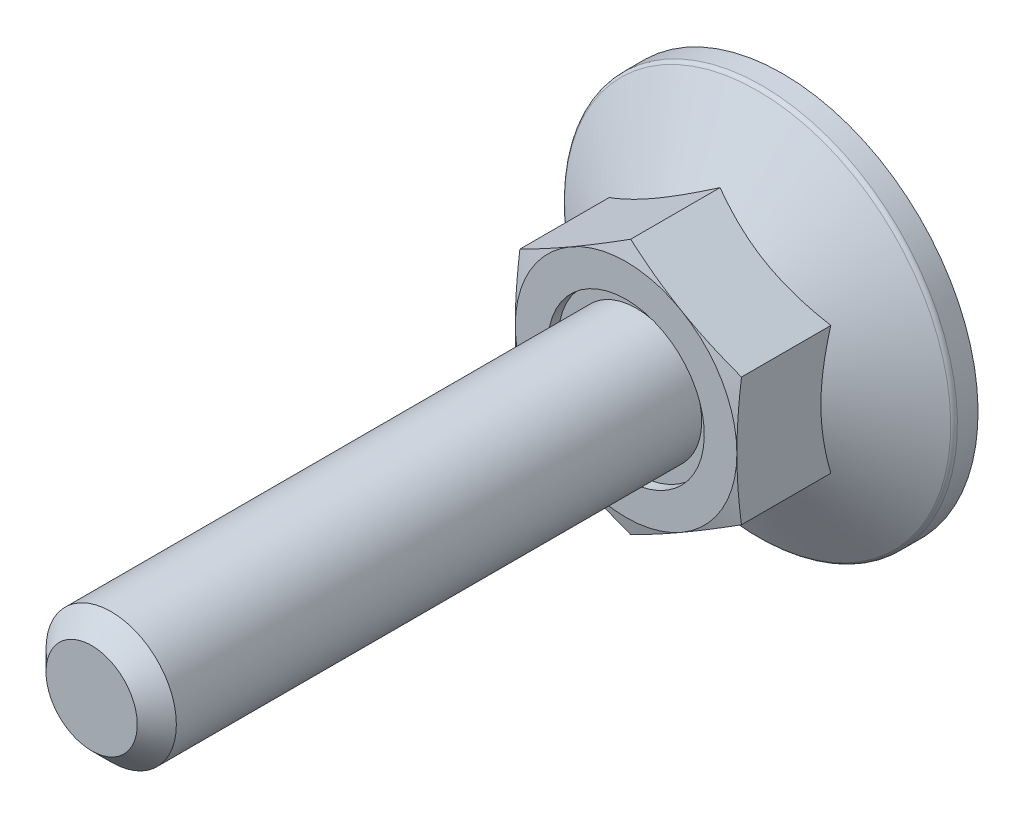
ISO-10303-21;
HEADER;
FILE_DESCRIPTION(('STEP AP214'),'2;1');
FILE_NAME('part.step','',(''),(''),'','','');
FILE_SCHEMA(('AUTOMOTIVE_DESIGN { 1 0 10303 214 1 1 1 1 }'));
ENDSEC;
DATA;
#1=APPLICATION_CONTEXT('core data for automotive mechanical design processes');
#2=APPLICATION_PROTOCOL_DEFINITION('international standard','automotive_design',2000,#1);
#3=PRODUCT_CONTEXT('',#1,'mechanical');
#4=PRODUCT('Part','Part','',(#3));
#5=PRODUCT_RELATED_PRODUCT_CATEGORY('part','',(#4));
#6=PRODUCT_DEFINITION_FORMATION('','',#4);
#7=PRODUCT_DEFINITION_CONTEXT('part definition',#1,'design');
#8=PRODUCT_DEFINITION('design','',#6,#7);
#9=PRODUCT_DEFINITION_SHAPE('','',#8);
#10=(LENGTH_UNIT() NAMED_UNIT(*) SI_UNIT(.MILLI.,.METRE.));
#11=(NAMED_UNIT(*) PLANE_ANGLE_UNIT() SI_UNIT($,.RADIAN.));
#12=(NAMED_UNIT(*) SI_UNIT($,.STERADIAN.) SOLID_ANGLE_UNIT());
#13=UNCERTAINTY_MEASURE_WITH_UNIT(LENGTH_MEASURE(1.E-05),#10,'distance_accuracy_value','');
#14=(GEOMETRIC_REPRESENTATION_CONTEXT(3) GLOBAL_UNCERTAINTY_ASSIGNED_CONTEXT((#13)) GLOBAL_UNIT_ASSIGNED_CONTEXT((#10,
#11,#12)) REPRESENTATION_CONTEXT('',''));
#15=CARTESIAN_POINT('',(0.,0.,0.));
#16=DIRECTION('',(0.,0.,1.));
#17=DIRECTION('',(1.,0.,0.));
#18=AXIS2_PLACEMENT_3D('',#15,#16,#17);
#19=CARTESIAN_POINT('',(0.,0.,11.2));
#20=DIRECTION('',(0.,0.,-1.));
#21=DIRECTION('',(0.,1.,0.));
#22=AXIS2_PLACEMENT_3D('',#19,#20,#21);
#23=PLANE('',#22);
#24=CARTESIAN_POINT('',(0.,0.,11.2));
#25=DIRECTION('',(0.,0.,-1.));
#26=DIRECTION('',(0.,1.,0.));
#27=AXIS2_PLACEMENT_3D('',#24,#25,#26);
#28=CIRCLE('',#27,6.);
#29=CARTESIAN_POINT('',(0.,6.,11.2));
#30=VERTEX_POINT('',#29);
#31=EDGE_CURVE('E108',#30,#30,#28,.T.);
#32=ORIENTED_EDGE('',*,*,#31,.F.);
#33=EDGE_LOOP('',(#32));
#34=FACE_BOUND('',#33,.T.);
#35=CARTESIAN_POINT('',(0.,0.,11.2));
#36=DIRECTION('',(0.,0.,-1.));
#37=DIRECTION('',(0.,1.,0.));
#38=AXIS2_PLACEMENT_3D('',#35,#36,#37);
#39=CIRCLE('',#38,5.);
#40=CARTESIAN_POINT('',(0.,5.,11.2));
#41=VERTEX_POINT('',#40);
#42=EDGE_CURVE('E259',#41,#41,#39,.F.);
#43=ORIENTED_EDGE('',*,*,#42,.F.);
#44=EDGE_LOOP('',(#43));
#45=FACE_BOUND('',#44,.T.);
#46=ADVANCED_FACE('F14',(#34,#45),#23,.F.);
#47=CARTESIAN_POINT('',(0.,9.81495457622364,32.));
#48=DIRECTION('',(0.5,-0.866025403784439,0.));
#49=DIRECTION('',(0.866025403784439,0.5,0.));
#50=AXIS2_PLACEMENT_3D('',#47,#48,#49);
#51=PLANE('',#50);
#52=CARTESIAN_POINT('',(-8.5002,4.90736181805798,4.7935207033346));
#53=CARTESIAN_POINT('',(-8.31336077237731,5.01523349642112,4.85579061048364));
#54=CARTESIAN_POINT('',(-8.1258249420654,5.1235073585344,4.91523445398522));
#55=CARTESIAN_POINT('',(-7.74923024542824,5.34093440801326,5.02769163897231));
#56=CARTESIAN_POINT('',(-7.56017075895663,5.45008795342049,5.08070220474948));
#57=CARTESIAN_POINT('',(-6.9899652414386,5.77929626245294,5.22904336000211));
#58=CARTESIAN_POINT('',(-6.60656835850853,6.00065055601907,5.31341782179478));
#59=CARTESIAN_POINT('',(-6.03282233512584,6.33190297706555,5.41235673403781));
#60=CARTESIAN_POINT('',(-5.84418723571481,6.44081150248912,5.44054155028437));
#61=CARTESIAN_POINT('',(-5.46606397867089,6.65912106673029,5.48780266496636));
#62=CARTESIAN_POINT('',(-5.27657589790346,6.76852206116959,5.5068797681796));
#63=CARTESIAN_POINT('',(-4.8972734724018,6.98751241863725,5.53544197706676));
#64=CARTESIAN_POINT('',(-4.70745974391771,7.09710142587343,5.54493796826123));
#65=CARTESIAN_POINT('',(-4.32765694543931,7.3163806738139,5.55413437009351));
#66=CARTESIAN_POINT('',(-4.13766788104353,7.42607091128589,5.55383508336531));
#67=CARTESIAN_POINT('',(-3.78247698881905,7.63114046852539,5.54412227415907));
#68=CARTESIAN_POINT('',(-3.6172500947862,7.72653426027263,5.53589358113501));
#69=CARTESIAN_POINT('',(-3.28718328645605,7.9170984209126,5.51218750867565));
#70=CARTESIAN_POINT('',(-3.12234339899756,8.01226877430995,5.49670964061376));
#71=CARTESIAN_POINT('',(-2.62846189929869,8.29741139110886,5.43976812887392));
#72=CARTESIAN_POINT('',(-2.30029449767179,8.48687892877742,5.38780368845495));
#73=CARTESIAN_POINT('',(-1.64047857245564,8.86782383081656,5.25789180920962));
#74=CARTESIAN_POINT('',(-1.30891425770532,9.05925257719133,5.17939367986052));
#75=CARTESIAN_POINT('',(-0.650730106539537,9.43925537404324,5.00123540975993));
#76=CARTESIAN_POINT('',(-0.32410184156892,9.62783429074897,4.90161711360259));
#77=CARTESIAN_POINT('',(0.000200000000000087,9.81507004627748,4.7935207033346));
#78=B_SPLINE_CURVE_WITH_KNOTS('',3,(#52,#53,#54,#55,#56,#57,#58,#59,#60,#61,#62,#63,#64,#65,#66,
#67,#68,#69,#70,#71,#72,#73,#74,#75,#76,#77),.UNSPECIFIED.,.F.,.F.,(4,2,2,2,2,2,2,2,2,2,2,2,4),
(0.,0.673596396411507,1.34748239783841,2.69805431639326,3.356799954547,4.01548737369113,
4.67342558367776,5.33134346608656,5.90409556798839,6.47688628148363,7.62328361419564,
8.79510569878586,9.9646274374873),.UNSPECIFIED.);
#79=CARTESIAN_POINT('',(-8.5,4.90747728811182,4.79358737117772));
#80=VERTEX_POINT('',#79);
#81=CARTESIAN_POINT('',(0.,9.81495457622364,4.79358737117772));
#82=VERTEX_POINT('',#81);
#83=EDGE_CURVE('E97',#80,#82,#78,.T.);
#84=ORIENTED_EDGE('',*,*,#83,.F.);
#85=DIRECTION('',(0.,0.,-1.));
#86=VECTOR('',#85,1.);
#87=CARTESIAN_POINT('',(-8.5,4.90747728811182,32.));
#88=LINE('',#87,#86);
#89=CARTESIAN_POINT('',(-8.5,4.90747728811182,11.6476589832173));
#90=VERTEX_POINT('',#89);
#91=EDGE_CURVE('E86',#90,#80,#88,.T.);
#92=ORIENTED_EDGE('',*,*,#91,.F.);
#93=CARTESIAN_POINT('',(0.000200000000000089,9.81507004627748,11.6476280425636));
#94=CARTESIAN_POINT('',(-0.352800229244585,9.61126526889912,11.7022599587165));
#95=CARTESIAN_POINT('',(-0.706440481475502,9.40709097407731,11.7518566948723));
#96=CARTESIAN_POINT('',(-1.41496987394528,8.99802133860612,11.8389934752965));
#97=CARTESIAN_POINT('',(-1.76985946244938,8.79312573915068,11.8765286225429));
#98=CARTESIAN_POINT('',(-2.47873586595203,8.38385575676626,11.9373509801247));
#99=CARTESIAN_POINT('',(-2.83271788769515,8.17948414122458,11.9607107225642));
#100=CARTESIAN_POINT('',(-3.5411333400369,7.77048028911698,11.9920337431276));
#101=CARTESIAN_POINT('',(-3.89556667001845,7.56584811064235,12.));
#102=CARTESIAN_POINT('',(-4.60443332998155,7.15658375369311,12.));
#103=CARTESIAN_POINT('',(-4.9588666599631,6.95195157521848,11.9920337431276));
#104=CARTESIAN_POINT('',(-5.66728211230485,6.54294772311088,11.9607107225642));
#105=CARTESIAN_POINT('',(-6.02126413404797,6.33857610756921,11.9373509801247));
#106=CARTESIAN_POINT('',(-6.73014053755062,5.92930612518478,11.8765286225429));
#107=CARTESIAN_POINT('',(-7.08503012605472,5.72441052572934,11.8389934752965));
#108=CARTESIAN_POINT('',(-7.7935595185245,5.31534089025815,11.7518566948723));
#109=CARTESIAN_POINT('',(-8.14719977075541,5.11116659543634,11.7022599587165));
#110=CARTESIAN_POINT('',(-8.5002,4.90736181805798,11.6476280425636));
#111=B_SPLINE_CURVE_WITH_KNOTS('',3,(#93,#94,#95,#96,#97,#98,#99,#100,#101,#102,#103,#104,#105,
#106,#107,#108,#109,#110),.UNSPECIFIED.,.F.,.F.,(4,2,2,2,2,2,2,2,4),(0.,1.23382789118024,
2.46815608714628,3.69611406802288,4.92383440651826,6.15155474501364,7.37951272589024,
8.61384092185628,9.84766881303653),.UNSPECIFIED.);
#112=CARTESIAN_POINT('',(-4.25,7.36121593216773,12.));
#113=VERTEX_POINT('',#112);
#114=EDGE_CURVE('E186',#113,#90,#111,.T.);
#115=ORIENTED_EDGE('',*,*,#114,.F.);
#116=CARTESIAN_POINT('',(0.,9.81495457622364,11.6476589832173));
#117=VERTEX_POINT('',#116);
#118=EDGE_CURVE('E318',#117,#113,#111,.T.);
#119=ORIENTED_EDGE('',*,*,#118,.F.);
#120=DIRECTION('',(0.,0.,-1.));
#121=VECTOR('',#120,1.);
#122=CARTESIAN_POINT('',(0.,9.81495457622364,32.));
#123=LINE('',#122,#121);
#124=EDGE_CURVE('E101',#117,#82,#123,.T.);
#125=ORIENTED_EDGE('',*,*,#124,.T.);
#126=EDGE_LOOP('',(#84,#92,#115,#119,#125));
#127=FACE_BOUND('',#126,.T.);
#128=ADVANCED_FACE('F100',(#127),#51,.F.);
#129=CARTESIAN_POINT('',(8.5,4.90747728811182,32.));
#130=DIRECTION('',(-0.5,-0.866025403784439,0.));
#131=DIRECTION('',(0.866025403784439,-0.5,0.));
#132=AXIS2_PLACEMENT_3D('',#129,#130,#131);
#133=PLANE('',#132);
#134=CARTESIAN_POINT('',(-0.0002,9.81507004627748,4.7935207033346));
#135=CARTESIAN_POINT('',(0.186639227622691,9.70719836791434,4.85579061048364));
#136=CARTESIAN_POINT('',(0.374175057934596,9.59892450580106,4.91523445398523));
#137=CARTESIAN_POINT('',(0.750769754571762,9.3814974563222,5.02769163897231));
#138=CARTESIAN_POINT('',(0.939829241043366,9.27234391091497,5.08070220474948));
#139=CARTESIAN_POINT('',(1.5100347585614,8.94313560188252,5.22904336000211));
#140=CARTESIAN_POINT('',(1.89343164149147,8.72178130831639,5.31341782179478));
#141=CARTESIAN_POINT('',(2.46717766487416,8.39052888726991,5.41235673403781));
#142=CARTESIAN_POINT('',(2.65581276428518,8.28162036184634,5.44054155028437));
#143=CARTESIAN_POINT('',(3.03393602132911,8.06331079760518,5.48780266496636));
#144=CARTESIAN_POINT('',(3.22342410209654,7.95390980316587,5.5068797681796));
#145=CARTESIAN_POINT('',(3.6027265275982,7.73491944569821,5.53544197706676));
#146=CARTESIAN_POINT('',(3.79254025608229,7.62533043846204,5.54493796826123));
#147=CARTESIAN_POINT('',(4.17234305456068,7.40605119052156,5.55413437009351));
#148=CARTESIAN_POINT('',(4.36233211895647,7.29636095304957,5.55383508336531));
#149=CARTESIAN_POINT('',(4.71752301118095,7.09129139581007,5.54412227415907));
#150=CARTESIAN_POINT('',(4.8827499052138,6.99589760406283,5.53589358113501));
#151=CARTESIAN_POINT('',(5.21281671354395,6.80533344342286,5.51218750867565));
#152=CARTESIAN_POINT('',(5.37765660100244,6.71016309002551,5.49670964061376));
#153=CARTESIAN_POINT('',(5.87153810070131,6.42502047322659,5.43976812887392));
#154=CARTESIAN_POINT('',(6.19970550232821,6.23555293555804,5.38780368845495));
#155=CARTESIAN_POINT('',(6.85952142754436,5.8546080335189,5.25789180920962));
#156=CARTESIAN_POINT('',(7.19108574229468,5.66317928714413,5.17939367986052));
#157=CARTESIAN_POINT('',(7.84926989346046,5.28317649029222,5.00123540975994));
#158=CARTESIAN_POINT('',(8.17589815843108,5.09459757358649,4.90161711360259));
#159=CARTESIAN_POINT('',(8.5002,4.90736181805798,4.7935207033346));
#160=B_SPLINE_CURVE_WITH_KNOTS('',3,(#134,#135,#136,#137,#138,#139,#140,#141,#142,#143,#144,
#145,#146,#147,#148,#149,#150,#151,#152,#153,#154,#155,#156,#157,#158,#159),.UNSPECIFIED.,.F.,
.F.,(4,2,2,2,2,2,2,2,2,2,2,2,4),(0.,0.673596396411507,1.34748239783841,2.69805431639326,
3.356799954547,4.01548737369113,4.67342558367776,5.33134346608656,5.90409556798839,
6.47688628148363,7.62328361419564,8.79510569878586,9.9646274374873),.UNSPECIFIED.);
#161=CARTESIAN_POINT('',(8.5,4.90747728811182,4.79358737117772));
#162=VERTEX_POINT('',#161);
#163=EDGE_CURVE('E29',#82,#162,#160,.T.);
#164=ORIENTED_EDGE('',*,*,#163,.F.);
#165=ORIENTED_EDGE('',*,*,#124,.F.);
#166=CARTESIAN_POINT('',(8.5002,4.90736181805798,11.6476280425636));
#167=CARTESIAN_POINT('',(8.14719977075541,5.11116659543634,11.7022599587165));
#168=CARTESIAN_POINT('',(7.7935595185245,5.31534089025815,11.7518566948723));
#169=CARTESIAN_POINT('',(7.08503012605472,5.72441052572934,11.8389934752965));
#170=CARTESIAN_POINT('',(6.73014053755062,5.92930612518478,11.8765286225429));
#171=CARTESIAN_POINT('',(6.02126413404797,6.33857610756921,11.9373509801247));
#172=CARTESIAN_POINT('',(5.66728211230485,6.54294772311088,11.9607107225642));
#173=CARTESIAN_POINT('',(4.9588666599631,6.95195157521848,11.9920337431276));
#174=CARTESIAN_POINT('',(4.60443332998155,7.15658375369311,12.));
#175=CARTESIAN_POINT('',(3.89556667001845,7.56584811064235,12.));
#176=CARTESIAN_POINT('',(3.5411333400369,7.77048028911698,11.9920337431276));
#177=CARTESIAN_POINT('',(2.83271788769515,8.17948414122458,11.9607107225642));
#178=CARTESIAN_POINT('',(2.47873586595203,8.38385575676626,11.9373509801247));
#179=CARTESIAN_POINT('',(1.76985946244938,8.79312573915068,11.8765286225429));
#180=CARTESIAN_POINT('',(1.41496987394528,8.99802133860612,11.8389934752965));
#181=CARTESIAN_POINT('',(0.706440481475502,9.40709097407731,11.7518566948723));
#182=CARTESIAN_POINT('',(0.352800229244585,9.61126526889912,11.7022599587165));
#183=CARTESIAN_POINT('',(-0.000200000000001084,9.81507004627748,11.6476280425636));
#184=B_SPLINE_CURVE_WITH_KNOTS('',3,(#166,#167,#168,#169,#170,#171,#172,#173,#174,#175,#176,
#177,#178,#179,#180,#181,#182,#183),.UNSPECIFIED.,.F.,.F.,(4,2,2,2,2,2,2,2,4),(0.,
1.23382789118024,2.46815608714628,3.69611406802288,4.92383440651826,6.15155474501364,
7.37951272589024,8.61384092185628,9.84766881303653),.UNSPECIFIED.);
#185=CARTESIAN_POINT('',(4.25,7.36121593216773,12.));
#186=VERTEX_POINT('',#185);
#187=EDGE_CURVE('E177',#186,#117,#184,.T.);
#188=ORIENTED_EDGE('',*,*,#187,.F.);
#189=CARTESIAN_POINT('',(8.5,4.90747728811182,11.6476589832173));
#190=VERTEX_POINT('',#189);
#191=EDGE_CURVE('E184',#190,#186,#184,.T.);
#192=ORIENTED_EDGE('',*,*,#191,.F.);
#193=DIRECTION('',(0.,0.,-1.));
#194=VECTOR('',#193,1.);
#195=CARTESIAN_POINT('',(8.5,4.90747728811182,32.));
#196=LINE('',#195,#194);
#197=EDGE_CURVE('E216',#190,#162,#196,.T.);
#198=ORIENTED_EDGE('',*,*,#197,.T.);
#199=EDGE_LOOP('',(#164,#165,#188,#192,#198));
#200=FACE_BOUND('',#199,.T.);
#201=ADVANCED_FACE('F192',(#200),#133,.F.);
#202=CARTESIAN_POINT('',(8.5,-4.90747728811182,32.));
#203=DIRECTION('',(-1.,0.,0.));
#204=DIRECTION('',(0.,-1.,0.));
#205=AXIS2_PLACEMENT_3D('',#202,#203,#204);
#206=PLANE('',#205);
#207=CARTESIAN_POINT('',(8.5,13.0314294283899,1.47752704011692));
#208=CARTESIAN_POINT('',(8.5,12.6612665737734,1.65647774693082));
#209=CARTESIAN_POINT('',(8.5,12.290237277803,1.83366776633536));
#210=CARTESIAN_POINT('',(8.5,11.5459841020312,2.1835324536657));
#211=CARTESIAN_POINT('',(8.5,11.1727598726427,2.3562063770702));
#212=CARTESIAN_POINT('',(8.5,10.4216603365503,2.69694543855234));
#213=CARTESIAN_POINT('',(8.5,10.0437706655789,2.86497902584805));
#214=CARTESIAN_POINT('',(8.5,9.2849306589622,3.19396010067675));
#215=CARTESIAN_POINT('',(8.5,8.90398047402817,3.35490793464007));
#216=CARTESIAN_POINT('',(8.5,8.12702308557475,3.67249615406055));
#217=CARTESIAN_POINT('',(8.5,7.73090483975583,3.82886642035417));
#218=CARTESIAN_POINT('',(8.5,6.93398073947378,4.12940330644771));
#219=CARTESIAN_POINT('',(8.5,6.53317435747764,4.27356853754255));
#220=CARTESIAN_POINT('',(8.5,5.72703031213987,4.54580160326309));
#221=CARTESIAN_POINT('',(8.5,5.32170421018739,4.67390329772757));
#222=CARTESIAN_POINT('',(8.5,4.50525785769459,4.90980359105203));
#223=CARTESIAN_POINT('',(8.5,4.09413952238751,5.01760873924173));
#224=CARTESIAN_POINT('',(8.5,3.26789885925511,5.20711197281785));
#225=CARTESIAN_POINT('',(8.5,2.85280627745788,5.28893618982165));
#226=CARTESIAN_POINT('',(8.5,2.22651264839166,5.38853539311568));
#227=CARTESIAN_POINT('',(8.5,2.01712321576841,5.41788026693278));
#228=CARTESIAN_POINT('',(8.5,1.59735566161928,5.46827917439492));
#229=CARTESIAN_POINT('',(8.5,1.38697763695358,5.48933400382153));
#230=CARTESIAN_POINT('',(8.5,0.968196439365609,5.52247691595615));
#231=CARTESIAN_POINT('',(8.5,0.759802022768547,5.53467524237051));
#232=CARTESIAN_POINT('',(8.5,0.342684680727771,5.55026003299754));
#233=CARTESIAN_POINT('',(8.5,0.133961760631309,5.5536466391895));
#234=CARTESIAN_POINT('',(8.5,-0.283445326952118,5.55152742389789));
#235=CARTESIAN_POINT('',(8.5,-0.492129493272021,5.546021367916));
#236=CARTESIAN_POINT('',(8.5,-0.909085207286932,5.52624824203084));
#237=CARTESIAN_POINT('',(8.5,-1.11735673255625,5.51198070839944));
#238=CARTESIAN_POINT('',(8.5,-1.62231800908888,5.46706351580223));
#239=CARTESIAN_POINT('',(8.5,-1.91862399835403,5.43201243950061));
#240=CARTESIAN_POINT('',(8.5,-2.50892471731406,5.34612267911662));
#241=CARTESIAN_POINT('',(8.5,-2.80291910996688,5.29528173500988));
#242=CARTESIAN_POINT('',(8.5,-3.68114216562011,5.12178025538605));
#243=CARTESIAN_POINT('',(8.5,-4.26128126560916,4.97817413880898));
#244=CARTESIAN_POINT('',(8.5,-5.12903133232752,4.73045572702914));
#245=CARTESIAN_POINT('',(8.5,-5.42116721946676,4.64129591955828));
#246=CARTESIAN_POINT('',(8.5,-6.0025970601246,4.45406394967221));
#247=CARTESIAN_POINT('',(8.5,-6.29189099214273,4.35599171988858));
#248=CARTESIAN_POINT('',(8.5,-6.86774141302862,4.15248019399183));
#249=CARTESIAN_POINT('',(8.5,-7.15429879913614,4.0470434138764));
#250=CARTESIAN_POINT('',(8.5,-7.72505625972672,3.83000899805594));
#251=CARTESIAN_POINT('',(8.5,-8.00925638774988,3.71841150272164));
#252=CARTESIAN_POINT('',(8.5,-8.7865968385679,3.40502511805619));
#253=CARTESIAN_POINT('',(8.5,-9.2776226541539,3.197996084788));
#254=CARTESIAN_POINT('',(8.5,-10.2546964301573,2.77246752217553));
#255=CARTESIAN_POINT('',(8.5,-10.7407438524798,2.55396676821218));
#256=CARTESIAN_POINT('',(8.5,-11.7090438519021,2.108282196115));
#257=CARTESIAN_POINT('',(8.5,-12.1912949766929,1.88109523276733));
#258=CARTESIAN_POINT('',(8.5,-13.1526185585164,1.42016244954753));
#259=CARTESIAN_POINT('',(8.5,-13.6316911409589,1.18641689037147));
#260=CARTESIAN_POINT('',(8.5,-14.588034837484,0.713462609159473));
#261=CARTESIAN_POINT('',(8.5,-15.0653020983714,0.47424611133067));
#262=CARTESIAN_POINT('',(8.5,-16.0177905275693,-0.00822936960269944));
#263=CARTESIAN_POINT('',(8.5,-16.4930116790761,-0.251488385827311));
#264=CARTESIAN_POINT('',(8.5,-17.4416812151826,-0.741191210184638));
#265=CARTESIAN_POINT('',(8.5,-17.9151299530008,-0.987634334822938));
#266=CARTESIAN_POINT('',(8.5,-18.8606492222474,-1.48315179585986));
#267=CARTESIAN_POINT('',(8.5,-19.3327197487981,-1.73222614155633));
#268=CARTESIAN_POINT('',(8.5,-20.6461392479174,-2.42904815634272));
#269=CARTESIAN_POINT('',(8.5,-21.4862394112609,-2.87914918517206));
#270=CARTESIAN_POINT('',(8.5,-23.1638169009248,-3.78432075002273));
#271=CARTESIAN_POINT('',(8.5,-24.0012940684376,-4.23939157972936));
#272=CARTESIAN_POINT('',(8.5,-25.671623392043,-5.15180725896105));
#273=CARTESIAN_POINT('',(8.5,-26.5044818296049,-5.60914061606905));
#274=CARTESIAN_POINT('',(8.5,-27.7525740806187,-6.29723391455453));
#275=CARTESIAN_POINT('',(8.5,-28.1683903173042,-6.52693873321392));
#276=CARTESIAN_POINT('',(8.5,-28.9996764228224,-6.98697325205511));
#277=CARTESIAN_POINT('',(8.5,-29.4151462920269,-7.21730295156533));
#278=CARTESIAN_POINT('',(8.5,-29.8304643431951,-7.44790614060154));
#279=B_SPLINE_CURVE_WITH_KNOTS('',3,(#207,#208,#209,#210,#211,#212,#213,#214,#215,#216,#217,
#218,#219,#220,#221,#222,#223,#224,#225,#226,#227,#228,#229,#230,#231,#232,#233,#234,#235,#236,
#237,#238,#239,#240,#241,#242,#243,#244,#245,#246,#247,#248,#249,#250,#251,#252,#253,#254,#255,
#256,#257,#258,#259,#260,#261,#262,#263,#264,#265,#266,#267,#268,#269,#270,#271,#272,#273,#274,
#275,#276,#277,#278),.UNSPECIFIED.,.F.,.F.,(4,2,2,2,2,2,2,2,2,2,2,2,2,2,2,2,2,2,2,2,2,2,2,2,2,2,
2,2,2,2,2,2,2,2,2,4),(0.,1.23346428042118,2.46713064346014,3.70776702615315,4.94834268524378,
6.22578289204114,7.5033682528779,8.77821366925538,10.0526470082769,11.32079515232,
11.9549638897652,12.5890717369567,13.2151443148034,13.8412068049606,14.4672858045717,
15.0933979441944,15.9880059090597,16.8827419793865,18.6732029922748,19.5894472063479,
20.5056983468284,21.4216379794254,22.3375567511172,23.9359919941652,25.5345982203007,
27.1337888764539,28.7329160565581,30.3344778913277,31.9360528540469,33.5372895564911,
35.1385319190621,37.9977422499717,40.8571224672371,43.7075995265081,45.1327331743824,
46.5578652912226),.UNSPECIFIED.);
#280=CARTESIAN_POINT('',(8.5,-4.90747728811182,4.79358737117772));
#281=VERTEX_POINT('',#280);
#282=EDGE_CURVE('E37',#162,#281,#279,.T.);
#283=ORIENTED_EDGE('',*,*,#282,.F.);
#284=ORIENTED_EDGE('',*,*,#197,.F.);
#285=CARTESIAN_POINT('',(8.5,12.9820891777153,10.1197370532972));
#286=CARTESIAN_POINT('',(8.5,12.5964686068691,10.2061594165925));
#287=CARTESIAN_POINT('',(8.5,12.2106068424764,10.2915248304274));
#288=CARTESIAN_POINT('',(8.5,11.4382824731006,10.4595712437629));
#289=CARTESIAN_POINT('',(8.5,11.0518198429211,10.5422521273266));
#290=CARTESIAN_POINT('',(8.5,10.2778290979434,10.7044309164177));
#291=CARTESIAN_POINT('',(8.5,9.89030030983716,10.7839256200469));
#292=CARTESIAN_POINT('',(8.5,9.11443612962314,10.9388739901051));
#293=CARTESIAN_POINT('',(8.5,8.72610074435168,11.0143276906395));
#294=CARTESIAN_POINT('',(8.5,7.95158013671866,11.159650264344));
#295=CARTESIAN_POINT('',(8.5,7.56540239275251,11.2295587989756));
#296=CARTESIAN_POINT('',(8.5,6.79199352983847,11.3632725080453));
#297=CARTESIAN_POINT('',(8.5,6.40476243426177,11.4270778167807));
#298=CARTESIAN_POINT('',(8.5,5.62917169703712,11.54714843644));
#299=CARTESIAN_POINT('',(8.5,5.24081220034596,11.6034146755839));
#300=CARTESIAN_POINT('',(8.5,4.46285737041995,11.70674908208));
#301=CARTESIAN_POINT('',(8.5,4.07326203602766,11.7538172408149));
#302=CARTESIAN_POINT('',(8.5,3.28844017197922,11.8374226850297));
#303=CARTESIAN_POINT('',(8.5,2.89320002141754,11.8738340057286));
#304=CARTESIAN_POINT('',(8.5,2.10172608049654,11.9336139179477));
#305=CARTESIAN_POINT('',(8.5,1.70549231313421,11.9569828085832));
#306=CARTESIAN_POINT('',(8.5,0.91260591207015,11.9893148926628));
#307=CARTESIAN_POINT('',(8.5,0.515953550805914,11.9982846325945));
#308=CARTESIAN_POINT('',(8.5,-0.277408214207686,12.0012669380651));
#309=CARTESIAN_POINT('',(8.5,-0.674117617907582,11.9952795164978));
#310=CARTESIAN_POINT('',(8.5,-1.46847963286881,11.9686842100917));
#311=CARTESIAN_POINT('',(8.5,-1.86613043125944,11.9480232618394));
#312=CARTESIAN_POINT('',(8.5,-2.66049684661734,11.8932602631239));
#313=CARTESIAN_POINT('',(8.5,-3.05721244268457,11.8591579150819));
#314=CARTESIAN_POINT('',(8.5,-3.84970511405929,11.7792347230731));
#315=CARTESIAN_POINT('',(8.5,-4.24548140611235,11.7334062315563));
#316=CARTESIAN_POINT('',(8.5,-5.03576028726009,11.6319377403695));
#317=CARTESIAN_POINT('',(8.5,-5.43026287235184,11.5762977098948));
#318=CARTESIAN_POINT('',(8.5,-6.19195385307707,11.4609360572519));
#319=CARTESIAN_POINT('',(8.5,-6.55922094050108,11.4017287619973));
#320=CARTESIAN_POINT('',(8.5,-7.29278719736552,11.2775674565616));
#321=CARTESIAN_POINT('',(8.5,-7.65908634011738,11.2126132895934));
#322=CARTESIAN_POINT('',(8.5,-8.39085027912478,11.078008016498));
#323=CARTESIAN_POINT('',(8.5,-8.75631499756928,11.0083564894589));
#324=CARTESIAN_POINT('',(8.5,-9.48649515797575,10.8652200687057));
#325=CARTESIAN_POINT('',(8.5,-9.85121059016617,10.7917351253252));
#326=CARTESIAN_POINT('',(8.5,-10.5800753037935,10.6416087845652));
#327=CARTESIAN_POINT('',(8.5,-10.944224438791,10.5649666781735));
#328=CARTESIAN_POINT('',(8.5,-11.6719684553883,10.4090909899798));
#329=CARTESIAN_POINT('',(8.5,-12.0355633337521,10.3298573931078));
#330=CARTESIAN_POINT('',(8.5,-13.1255915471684,10.0889686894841));
#331=CARTESIAN_POINT('',(8.5,-13.8513178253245,9.92411536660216));
#332=CARTESIAN_POINT('',(8.5,-15.2942598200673,9.59010912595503));
#333=CARTESIAN_POINT('',(8.5,-16.0114890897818,9.42101437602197));
#334=CARTESIAN_POINT('',(8.5,-17.4449475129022,9.07858755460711));
#335=CARTESIAN_POINT('',(8.5,-18.1611766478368,8.90525540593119));
#336=CARTESIAN_POINT('',(8.5,-19.5919856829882,8.5556799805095));
#337=CARTESIAN_POINT('',(8.5,-20.306566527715,8.37944056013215));
#338=CARTESIAN_POINT('',(8.5,-21.7351057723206,8.02455520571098));
#339=CARTESIAN_POINT('',(8.5,-22.4490641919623,7.8459093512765));
#340=CARTESIAN_POINT('',(8.5,-23.1628057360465,7.66641079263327));
#341=B_SPLINE_CURVE_WITH_KNOTS('',3,(#285,#286,#287,#288,#289,#290,#291,#292,#293,#294,#295,
#296,#297,#298,#299,#300,#301,#302,#303,#304,#305,#306,#307,#308,#309,#310,#311,#312,#313,#314,
#315,#316,#317,#318,#319,#320,#321,#322,#323,#324,#325,#326,#327,#328,#329,#330,#331,#332,#333,
#334,#335,#336,#337,#338,#339,#340),.UNSPECIFIED.,.F.,.F.,(4,2,2,2,2,2,2,2,2,2,2,2,2,2,2,2,2,2,
2,2,2,2,2,2,2,2,2,4),(0.,1.18556310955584,2.37117735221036,3.55795462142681,4.74472187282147,
5.92204594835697,7.09934411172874,8.27649719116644,9.45365137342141,10.6442044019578,
11.8347301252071,13.0247144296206,14.2146977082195,15.4090063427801,16.6033414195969,
17.7984574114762,18.9935771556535,20.1095500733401,21.2255534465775,22.3416569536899,
23.4577749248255,24.5741449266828,25.6905214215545,27.9231231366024,30.1337863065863,
32.3444897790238,34.5524651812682,36.7603677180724),.UNSPECIFIED.);
#342=CARTESIAN_POINT('',(8.5,0.,12.));
#343=VERTEX_POINT('',#342);
#344=EDGE_CURVE('E170',#343,#190,#341,.F.);
#345=ORIENTED_EDGE('',*,*,#344,.F.);
#346=CARTESIAN_POINT('',(8.5,-4.90747728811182,11.6476589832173));
#347=VERTEX_POINT('',#346);
#348=EDGE_CURVE('E185',#347,#343,#341,.F.);
#349=ORIENTED_EDGE('',*,*,#348,.F.);
#350=DIRECTION('',(0.,0.,-1.));
#351=VECTOR('',#350,1.);
#352=CARTESIAN_POINT('',(8.5,-4.90747728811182,32.));
#353=LINE('',#352,#351);
#354=EDGE_CURVE('E218',#347,#281,#353,.T.);
#355=ORIENTED_EDGE('',*,*,#354,.T.);
#356=EDGE_LOOP('',(#283,#284,#345,#349,#355));
#357=FACE_BOUND('',#356,.T.);
#358=ADVANCED_FACE('F195',(#357),#206,.F.);
#359=CARTESIAN_POINT('',(0.,-9.81495457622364,32.));
#360=DIRECTION('',(-0.5,0.866025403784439,0.));
#361=DIRECTION('',(-0.866025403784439,-0.5,0.));
#362=AXIS2_PLACEMENT_3D('',#359,#360,#361);
#363=PLANE('',#362);
#364=CARTESIAN_POINT('',(8.5002,-4.90736181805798,4.7935207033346));
#365=CARTESIAN_POINT('',(8.31336077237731,-5.01523349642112,4.85579061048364));
#366=CARTESIAN_POINT('',(8.1258249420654,-5.1235073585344,4.91523445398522));
#367=CARTESIAN_POINT('',(7.74923024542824,-5.34093440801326,5.02769163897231));
#368=CARTESIAN_POINT('',(7.56017075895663,-5.45008795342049,5.08070220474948));
#369=CARTESIAN_POINT('',(6.9899652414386,-5.77929626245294,5.22904336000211));
#370=CARTESIAN_POINT('',(6.60656835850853,-6.00065055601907,5.31341782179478));
#371=CARTESIAN_POINT('',(6.03282233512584,-6.33190297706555,5.41235673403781));
#372=CARTESIAN_POINT('',(5.84418723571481,-6.44081150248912,5.44054155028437));
#373=CARTESIAN_POINT('',(5.46606397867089,-6.65912106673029,5.48780266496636));
#374=CARTESIAN_POINT('',(5.27657589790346,-6.76852206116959,5.5068797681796));
#375=CARTESIAN_POINT('',(4.8972734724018,-6.98751241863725,5.53544197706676));
#376=CARTESIAN_POINT('',(4.70745974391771,-7.09710142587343,5.54493796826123));
#377=CARTESIAN_POINT('',(4.32765694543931,-7.3163806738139,5.55413437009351));
#378=CARTESIAN_POINT('',(4.13766788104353,-7.42607091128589,5.55383508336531));
#379=CARTESIAN_POINT('',(3.78247698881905,-7.63114046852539,5.54412227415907));
#380=CARTESIAN_POINT('',(3.6172500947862,-7.72653426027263,5.53589358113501));
#381=CARTESIAN_POINT('',(3.28718328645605,-7.9170984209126,5.51218750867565));
#382=CARTESIAN_POINT('',(3.12234339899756,-8.01226877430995,5.49670964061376));
#383=CARTESIAN_POINT('',(2.62846189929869,-8.29741139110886,5.43976812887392));
#384=CARTESIAN_POINT('',(2.30029449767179,-8.48687892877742,5.38780368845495));
#385=CARTESIAN_POINT('',(1.64047857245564,-8.86782383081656,5.25789180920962));
#386=CARTESIAN_POINT('',(1.30891425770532,-9.05925257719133,5.17939367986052));
#387=CARTESIAN_POINT('',(0.650730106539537,-9.43925537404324,5.00123540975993));
#388=CARTESIAN_POINT('',(0.32410184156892,-9.62783429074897,4.90161711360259));
#389=CARTESIAN_POINT('',(-0.000200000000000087,-9.81507004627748,4.7935207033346));
#390=B_SPLINE_CURVE_WITH_KNOTS('',3,(#364,#365,#366,#367,#368,#369,#370,#371,#372,#373,#374,
#375,#376,#377,#378,#379,#380,#381,#382,#383,#384,#385,#386,#387,#388,#389),.UNSPECIFIED.,.F.,
.F.,(4,2,2,2,2,2,2,2,2,2,2,2,4),(0.,0.673596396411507,1.34748239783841,2.69805431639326,
3.356799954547,4.01548737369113,4.67342558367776,5.33134346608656,5.90409556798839,
6.47688628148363,7.62328361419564,8.79510569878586,9.9646274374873),.UNSPECIFIED.);
#391=CARTESIAN_POINT('',(0.,-9.81495457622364,4.79358737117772));
#392=VERTEX_POINT('',#391);
#393=EDGE_CURVE('E276',#281,#392,#390,.T.);
#394=ORIENTED_EDGE('',*,*,#393,.F.);
#395=ORIENTED_EDGE('',*,*,#354,.F.);
#396=CARTESIAN_POINT('',(-0.000200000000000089,-9.81507004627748,11.6476280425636));
#397=CARTESIAN_POINT('',(0.352800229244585,-9.61126526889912,11.7022599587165));
#398=CARTESIAN_POINT('',(0.706440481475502,-9.40709097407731,11.7518566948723));
#399=CARTESIAN_POINT('',(1.41496987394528,-8.99802133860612,11.8389934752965));
#400=CARTESIAN_POINT('',(1.76985946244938,-8.79312573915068,11.8765286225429));
#401=CARTESIAN_POINT('',(2.47873586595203,-8.38385575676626,11.9373509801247));
#402=CARTESIAN_POINT('',(2.83271788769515,-8.17948414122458,11.9607107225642));
#403=CARTESIAN_POINT('',(3.5411333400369,-7.77048028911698,11.9920337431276));
#404=CARTESIAN_POINT('',(3.89556667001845,-7.56584811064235,12.));
#405=CARTESIAN_POINT('',(4.60443332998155,-7.15658375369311,12.));
#406=CARTESIAN_POINT('',(4.9588666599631,-6.95195157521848,11.9920337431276));
#407=CARTESIAN_POINT('',(5.66728211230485,-6.54294772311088,11.9607107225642));
#408=CARTESIAN_POINT('',(6.02126413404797,-6.33857610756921,11.9373509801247));
#409=CARTESIAN_POINT('',(6.73014053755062,-5.92930612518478,11.8765286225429));
#410=CARTESIAN_POINT('',(7.08503012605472,-5.72441052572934,11.8389934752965));
#411=CARTESIAN_POINT('',(7.7935595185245,-5.31534089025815,11.7518566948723));
#412=CARTESIAN_POINT('',(8.14719977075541,-5.11116659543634,11.7022599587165));
#413=CARTESIAN_POINT('',(8.5002,-4.90736181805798,11.6476280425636));
#414=B_SPLINE_CURVE_WITH_KNOTS('',3,(#396,#397,#398,#399,#400,#401,#402,#403,#404,#405,#406,
#407,#408,#409,#410,#411,#412,#413),.UNSPECIFIED.,.F.,.F.,(4,2,2,2,2,2,2,2,4),(0.,
1.23382789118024,2.46815608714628,3.69611406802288,4.92383440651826,6.15155474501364,
7.37951272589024,8.61384092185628,9.84766881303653),.UNSPECIFIED.);
#415=CARTESIAN_POINT('',(4.25,-7.36121593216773,12.));
#416=VERTEX_POINT('',#415);
#417=EDGE_CURVE('E164',#416,#347,#414,.T.);
#418=ORIENTED_EDGE('',*,*,#417,.F.);
#419=CARTESIAN_POINT('',(0.,-9.81495457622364,11.6476589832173));
#420=VERTEX_POINT('',#419);
#421=EDGE_CURVE('E299',#420,#416,#414,.T.);
#422=ORIENTED_EDGE('',*,*,#421,.F.);
#423=DIRECTION('',(0.,0.,-1.));
#424=VECTOR('',#423,1.);
#425=CARTESIAN_POINT('',(0.,-9.81495457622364,32.));
#426=LINE('',#425,#424);
#427=EDGE_CURVE('E220',#420,#392,#426,.T.);
#428=ORIENTED_EDGE('',*,*,#427,.T.);
#429=EDGE_LOOP('',(#394,#395,#418,#422,#428));
#430=FACE_BOUND('',#429,.T.);
#431=ADVANCED_FACE('F281',(#430),#363,.F.);
#432=CARTESIAN_POINT('',(-8.5,-4.90747728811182,32.));
#433=DIRECTION('',(0.5,0.866025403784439,0.));
#434=DIRECTION('',(-0.866025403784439,0.5,0.));
#435=AXIS2_PLACEMENT_3D('',#432,#433,#434);
#436=PLANE('',#435);
#437=CARTESIAN_POINT('',(0.0002,-9.81507004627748,4.7935207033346));
#438=CARTESIAN_POINT('',(-0.186639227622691,-9.70719836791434,4.85579061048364));
#439=CARTESIAN_POINT('',(-0.374175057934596,-9.59892450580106,4.91523445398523));
#440=CARTESIAN_POINT('',(-0.750769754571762,-9.3814974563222,5.02769163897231));
#441=CARTESIAN_POINT('',(-0.939829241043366,-9.27234391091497,5.08070220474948));
#442=CARTESIAN_POINT('',(-1.5100347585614,-8.94313560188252,5.22904336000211));
#443=CARTESIAN_POINT('',(-1.89343164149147,-8.72178130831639,5.31341782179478));
#444=CARTESIAN_POINT('',(-2.46717766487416,-8.39052888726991,5.41235673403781));
#445=CARTESIAN_POINT('',(-2.65581276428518,-8.28162036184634,5.44054155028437));
#446=CARTESIAN_POINT('',(-3.03393602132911,-8.06331079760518,5.48780266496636));
#447=CARTESIAN_POINT('',(-3.22342410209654,-7.95390980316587,5.5068797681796));
#448=CARTESIAN_POINT('',(-3.6027265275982,-7.73491944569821,5.53544197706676));
#449=CARTESIAN_POINT('',(-3.79254025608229,-7.62533043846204,5.54493796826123));
#450=CARTESIAN_POINT('',(-4.17234305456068,-7.40605119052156,5.55413437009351));
#451=CARTESIAN_POINT('',(-4.36233211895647,-7.29636095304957,5.55383508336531));
#452=CARTESIAN_POINT('',(-4.71752301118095,-7.09129139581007,5.54412227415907));
#453=CARTESIAN_POINT('',(-4.8827499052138,-6.99589760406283,5.53589358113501));
#454=CARTESIAN_POINT('',(-5.21281671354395,-6.80533344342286,5.51218750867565));
#455=CARTESIAN_POINT('',(-5.37765660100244,-6.71016309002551,5.49670964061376));
#456=CARTESIAN_POINT('',(-5.87153810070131,-6.42502047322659,5.43976812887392));
#457=CARTESIAN_POINT('',(-6.19970550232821,-6.23555293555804,5.38780368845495));
#458=CARTESIAN_POINT('',(-6.85952142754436,-5.8546080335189,5.25789180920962));
#459=CARTESIAN_POINT('',(-7.19108574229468,-5.66317928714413,5.17939367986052));
#460=CARTESIAN_POINT('',(-7.84926989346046,-5.28317649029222,5.00123540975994));
#461=CARTESIAN_POINT('',(-8.17589815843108,-5.09459757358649,4.90161711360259));
#462=CARTESIAN_POINT('',(-8.5002,-4.90736181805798,4.7935207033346));
#463=B_SPLINE_CURVE_WITH_KNOTS('',3,(#437,#438,#439,#440,#441,#442,#443,#444,#445,#446,#447,
#448,#449,#450,#451,#452,#453,#454,#455,#456,#457,#458,#459,#460,#461,#462),.UNSPECIFIED.,.F.,
.F.,(4,2,2,2,2,2,2,2,2,2,2,2,4),(0.,0.673596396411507,1.34748239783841,2.69805431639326,
3.356799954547,4.01548737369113,4.67342558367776,5.33134346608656,5.90409556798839,
6.47688628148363,7.62328361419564,8.79510569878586,9.9646274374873),.UNSPECIFIED.);
#464=CARTESIAN_POINT('',(-8.5,-4.90747728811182,4.79358737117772));
#465=VERTEX_POINT('',#464);
#466=EDGE_CURVE('E107',#392,#465,#463,.T.);
#467=ORIENTED_EDGE('',*,*,#466,.F.);
#468=ORIENTED_EDGE('',*,*,#427,.F.);
#469=CARTESIAN_POINT('',(-8.5002,-4.90736181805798,11.6476280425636));
#470=CARTESIAN_POINT('',(-8.14719977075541,-5.11116659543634,11.7022599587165));
#471=CARTESIAN_POINT('',(-7.7935595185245,-5.31534089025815,11.7518566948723));
#472=CARTESIAN_POINT('',(-7.08503012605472,-5.72441052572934,11.8389934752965));
#473=CARTESIAN_POINT('',(-6.73014053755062,-5.92930612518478,11.8765286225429));
#474=CARTESIAN_POINT('',(-6.02126413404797,-6.33857610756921,11.9373509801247));
#475=CARTESIAN_POINT('',(-5.66728211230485,-6.54294772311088,11.9607107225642));
#476=CARTESIAN_POINT('',(-4.9588666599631,-6.95195157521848,11.9920337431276));
#477=CARTESIAN_POINT('',(-4.60443332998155,-7.15658375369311,12.));
#478=CARTESIAN_POINT('',(-3.89556667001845,-7.56584811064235,12.));
#479=CARTESIAN_POINT('',(-3.5411333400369,-7.77048028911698,11.9920337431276));
#480=CARTESIAN_POINT('',(-2.83271788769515,-8.17948414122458,11.9607107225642));
#481=CARTESIAN_POINT('',(-2.47873586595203,-8.38385575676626,11.9373509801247));
#482=CARTESIAN_POINT('',(-1.76985946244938,-8.79312573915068,11.8765286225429));
#483=CARTESIAN_POINT('',(-1.41496987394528,-8.99802133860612,11.8389934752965));
#484=CARTESIAN_POINT('',(-0.706440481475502,-9.40709097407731,11.7518566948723));
#485=CARTESIAN_POINT('',(-0.352800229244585,-9.61126526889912,11.7022599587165));
#486=CARTESIAN_POINT('',(0.000200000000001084,-9.81507004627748,11.6476280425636));
#487=B_SPLINE_CURVE_WITH_KNOTS('',3,(#469,#470,#471,#472,#473,#474,#475,#476,#477,#478,#479,
#480,#481,#482,#483,#484,#485,#486),.UNSPECIFIED.,.F.,.F.,(4,2,2,2,2,2,2,2,4),(0.,
1.23382789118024,2.46815608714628,3.69611406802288,4.92383440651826,6.15155474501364,
7.37951272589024,8.61384092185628,9.84766881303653),.UNSPECIFIED.);
#488=CARTESIAN_POINT('',(-4.25,-7.36121593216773,12.));
#489=VERTEX_POINT('',#488);
#490=EDGE_CURVE('E144',#489,#420,#487,.T.);
#491=ORIENTED_EDGE('',*,*,#490,.F.);
#492=CARTESIAN_POINT('',(-8.5,-4.90747728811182,11.6476589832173));
#493=VERTEX_POINT('',#492);
#494=EDGE_CURVE('E226',#493,#489,#487,.T.);
#495=ORIENTED_EDGE('',*,*,#494,.F.);
#496=DIRECTION('',(0.,0.,-1.));
#497=VECTOR('',#496,1.);
#498=CARTESIAN_POINT('',(-8.5,-4.90747728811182,32.));
#499=LINE('',#498,#497);
#500=EDGE_CURVE('E96',#493,#465,#499,.T.);
#501=ORIENTED_EDGE('',*,*,#500,.T.);
#502=EDGE_LOOP('',(#467,#468,#491,#495,#501));
#503=FACE_BOUND('',#502,.T.);
#504=ADVANCED_FACE('F129',(#503),#436,.F.);
#505=CARTESIAN_POINT('',(-8.5,4.90747728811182,32.));
#506=DIRECTION('',(1.,0.,0.));
#507=DIRECTION('',(0.,1.,0.));
#508=AXIS2_PLACEMENT_3D('',#505,#506,#507);
#509=PLANE('',#508);
#510=CARTESIAN_POINT('',(-8.5,13.0314294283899,1.47752704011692));
#511=CARTESIAN_POINT('',(-8.5,12.6612665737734,1.65647774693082));
#512=CARTESIAN_POINT('',(-8.5,12.290237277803,1.83366776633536));
#513=CARTESIAN_POINT('',(-8.5,11.5459841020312,2.1835324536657));
#514=CARTESIAN_POINT('',(-8.5,11.1727598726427,2.3562063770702));
#515=CARTESIAN_POINT('',(-8.5,10.4216603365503,2.69694543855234));
#516=CARTESIAN_POINT('',(-8.5,10.0437706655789,2.86497902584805));
#517=CARTESIAN_POINT('',(-8.5,9.2849306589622,3.19396010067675));
#518=CARTESIAN_POINT('',(-8.5,8.90398047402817,3.35490793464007));
#519=CARTESIAN_POINT('',(-8.5,8.12702308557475,3.67249615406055));
#520=CARTESIAN_POINT('',(-8.5,7.73090483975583,3.82886642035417));
#521=CARTESIAN_POINT('',(-8.5,6.93398073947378,4.12940330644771));
#522=CARTESIAN_POINT('',(-8.5,6.53317435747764,4.27356853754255));
#523=CARTESIAN_POINT('',(-8.5,5.72703031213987,4.54580160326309));
#524=CARTESIAN_POINT('',(-8.5,5.32170421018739,4.67390329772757));
#525=CARTESIAN_POINT('',(-8.5,4.50525785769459,4.90980359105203));
#526=CARTESIAN_POINT('',(-8.5,4.09413952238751,5.01760873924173));
#527=CARTESIAN_POINT('',(-8.5,3.26789885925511,5.20711197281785));
#528=CARTESIAN_POINT('',(-8.5,2.85280627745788,5.28893618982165));
#529=CARTESIAN_POINT('',(-8.5,2.22651264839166,5.38853539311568));
#530=CARTESIAN_POINT('',(-8.5,2.01712321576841,5.41788026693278));
#531=CARTESIAN_POINT('',(-8.5,1.59735566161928,5.46827917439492));
#532=CARTESIAN_POINT('',(-8.5,1.38697763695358,5.48933400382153));
#533=CARTESIAN_POINT('',(-8.5,0.968196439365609,5.52247691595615));
#534=CARTESIAN_POINT('',(-8.5,0.759802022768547,5.53467524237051));
#535=CARTESIAN_POINT('',(-8.5,0.342684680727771,5.55026003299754));
#536=CARTESIAN_POINT('',(-8.5,0.133961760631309,5.5536466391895));
#537=CARTESIAN_POINT('',(-8.5,-0.283445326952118,5.55152742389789));
#538=CARTESIAN_POINT('',(-8.5,-0.492129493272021,5.546021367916));
#539=CARTESIAN_POINT('',(-8.5,-0.909085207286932,5.52624824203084));
#540=CARTESIAN_POINT('',(-8.5,-1.11735673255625,5.51198070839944));
#541=CARTESIAN_POINT('',(-8.5,-1.62231800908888,5.46706351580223));
#542=CARTESIAN_POINT('',(-8.5,-1.91862399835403,5.43201243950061));
#543=CARTESIAN_POINT('',(-8.5,-2.50892471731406,5.34612267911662));
#544=CARTESIAN_POINT('',(-8.5,-2.80291910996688,5.29528173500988));
#545=CARTESIAN_POINT('',(-8.5,-3.68114216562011,5.12178025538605));
#546=CARTESIAN_POINT('',(-8.5,-4.26128126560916,4.97817413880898));
#547=CARTESIAN_POINT('',(-8.5,-5.12903133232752,4.73045572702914));
#548=CARTESIAN_POINT('',(-8.5,-5.42116721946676,4.64129591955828));
#549=CARTESIAN_POINT('',(-8.5,-6.0025970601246,4.45406394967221));
#550=CARTESIAN_POINT('',(-8.5,-6.29189099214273,4.35599171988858));
#551=CARTESIAN_POINT('',(-8.5,-6.86774141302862,4.15248019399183));
#552=CARTESIAN_POINT('',(-8.5,-7.15429879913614,4.0470434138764));
#553=CARTESIAN_POINT('',(-8.5,-7.72505625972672,3.83000899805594));
#554=CARTESIAN_POINT('',(-8.5,-8.00925638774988,3.71841150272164));
#555=CARTESIAN_POINT('',(-8.5,-8.7865968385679,3.40502511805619));
#556=CARTESIAN_POINT('',(-8.5,-9.2776226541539,3.197996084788));
#557=CARTESIAN_POINT('',(-8.5,-10.2546964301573,2.77246752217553));
#558=CARTESIAN_POINT('',(-8.5,-10.7407438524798,2.55396676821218));
#559=CARTESIAN_POINT('',(-8.5,-11.7090438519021,2.108282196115));
#560=CARTESIAN_POINT('',(-8.5,-12.1912949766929,1.88109523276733));
#561=CARTESIAN_POINT('',(-8.5,-13.1526185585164,1.42016244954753));
#562=CARTESIAN_POINT('',(-8.5,-13.6316911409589,1.18641689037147));
#563=CARTESIAN_POINT('',(-8.5,-14.588034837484,0.713462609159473));
#564=CARTESIAN_POINT('',(-8.5,-15.0653020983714,0.47424611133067));
#565=CARTESIAN_POINT('',(-8.5,-16.0177905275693,-0.00822936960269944));
#566=CARTESIAN_POINT('',(-8.5,-16.4930116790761,-0.251488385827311));
#567=CARTESIAN_POINT('',(-8.5,-17.4416812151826,-0.741191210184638));
#568=CARTESIAN_POINT('',(-8.5,-17.9151299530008,-0.987634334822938));
#569=CARTESIAN_POINT('',(-8.5,-18.8606492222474,-1.48315179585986));
#570=CARTESIAN_POINT('',(-8.5,-19.3327197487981,-1.73222614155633));
#571=CARTESIAN_POINT('',(-8.5,-20.6461392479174,-2.42904815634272));
#572=CARTESIAN_POINT('',(-8.5,-21.4862394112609,-2.87914918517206));
#573=CARTESIAN_POINT('',(-8.5,-23.1638169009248,-3.78432075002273));
#574=CARTESIAN_POINT('',(-8.5,-24.0012940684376,-4.23939157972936));
#575=CARTESIAN_POINT('',(-8.5,-25.671623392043,-5.15180725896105));
#576=CARTESIAN_POINT('',(-8.5,-26.5044818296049,-5.60914061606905));
#577=CARTESIAN_POINT('',(-8.5,-27.7525740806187,-6.29723391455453));
#578=CARTESIAN_POINT('',(-8.5,-28.1683903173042,-6.52693873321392));
#579=CARTESIAN_POINT('',(-8.5,-28.9996764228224,-6.98697325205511));
#580=CARTESIAN_POINT('',(-8.5,-29.4151462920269,-7.21730295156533));
#581=CARTESIAN_POINT('',(-8.5,-29.8304643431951,-7.44790614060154));
#582=B_SPLINE_CURVE_WITH_KNOTS('',3,(#510,#511,#512,#513,#514,#515,#516,#517,#518,#519,#520,
#521,#522,#523,#524,#525,#526,#527,#528,#529,#530,#531,#532,#533,#534,#535,#536,#537,#538,#539,
#540,#541,#542,#543,#544,#545,#546,#547,#548,#549,#550,#551,#552,#553,#554,#555,#556,#557,#558,
#559,#560,#561,#562,#563,#564,#565,#566,#567,#568,#569,#570,#571,#572,#573,#574,#575,#576,#577,
#578,#579,#580,#581),.UNSPECIFIED.,.F.,.F.,(4,2,2,2,2,2,2,2,2,2,2,2,2,2,2,2,2,2,2,2,2,2,2,2,2,2,
2,2,2,2,2,2,2,2,2,4),(0.,1.23346428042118,2.46713064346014,3.70776702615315,4.94834268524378,
6.22578289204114,7.5033682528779,8.77821366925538,10.0526470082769,11.32079515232,
11.9549638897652,12.5890717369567,13.2151443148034,13.8412068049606,14.4672858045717,
15.0933979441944,15.9880059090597,16.8827419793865,18.6732029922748,19.5894472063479,
20.5056983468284,21.4216379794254,22.3375567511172,23.9359919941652,25.5345982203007,
27.1337888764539,28.7329160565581,30.3344778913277,31.9360528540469,33.5372895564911,
35.1385319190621,37.9977422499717,40.8571224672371,43.7075995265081,45.1327331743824,
46.5578652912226),.UNSPECIFIED.);
#583=EDGE_CURVE('E90',#465,#80,#582,.F.);
#584=ORIENTED_EDGE('',*,*,#583,.F.);
#585=ORIENTED_EDGE('',*,*,#500,.F.);
#586=CARTESIAN_POINT('',(-8.5,12.9820891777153,10.1197370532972));
#587=CARTESIAN_POINT('',(-8.5,12.5964686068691,10.2061594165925));
#588=CARTESIAN_POINT('',(-8.5,12.2106068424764,10.2915248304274));
#589=CARTESIAN_POINT('',(-8.5,11.4382824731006,10.4595712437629));
#590=CARTESIAN_POINT('',(-8.5,11.0518198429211,10.5422521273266));
#591=CARTESIAN_POINT('',(-8.5,10.2778290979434,10.7044309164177));
#592=CARTESIAN_POINT('',(-8.5,9.89030030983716,10.7839256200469));
#593=CARTESIAN_POINT('',(-8.5,9.11443612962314,10.9388739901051));
#594=CARTESIAN_POINT('',(-8.5,8.72610074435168,11.0143276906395));
#595=CARTESIAN_POINT('',(-8.5,7.95158013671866,11.159650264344));
#596=CARTESIAN_POINT('',(-8.5,7.56540239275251,11.2295587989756));
#597=CARTESIAN_POINT('',(-8.5,6.79199352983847,11.3632725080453));
#598=CARTESIAN_POINT('',(-8.5,6.40476243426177,11.4270778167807));
#599=CARTESIAN_POINT('',(-8.5,5.62917169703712,11.54714843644));
#600=CARTESIAN_POINT('',(-8.5,5.24081220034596,11.6034146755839));
#601=CARTESIAN_POINT('',(-8.5,4.46285737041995,11.70674908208));
#602=CARTESIAN_POINT('',(-8.5,4.07326203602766,11.7538172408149));
#603=CARTESIAN_POINT('',(-8.5,3.28844017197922,11.8374226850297));
#604=CARTESIAN_POINT('',(-8.5,2.89320002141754,11.8738340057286));
#605=CARTESIAN_POINT('',(-8.5,2.10172608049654,11.9336139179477));
#606=CARTESIAN_POINT('',(-8.5,1.70549231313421,11.9569828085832));
#607=CARTESIAN_POINT('',(-8.5,0.91260591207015,11.9893148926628));
#608=CARTESIAN_POINT('',(-8.5,0.515953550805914,11.9982846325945));
#609=CARTESIAN_POINT('',(-8.5,-0.277408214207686,12.0012669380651));
#610=CARTESIAN_POINT('',(-8.5,-0.674117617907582,11.9952795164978));
#611=CARTESIAN_POINT('',(-8.5,-1.46847963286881,11.9686842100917));
#612=CARTESIAN_POINT('',(-8.5,-1.86613043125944,11.9480232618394));
#613=CARTESIAN_POINT('',(-8.5,-2.66049684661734,11.8932602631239));
#614=CARTESIAN_POINT('',(-8.5,-3.05721244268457,11.8591579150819));
#615=CARTESIAN_POINT('',(-8.5,-3.84970511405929,11.7792347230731));
#616=CARTESIAN_POINT('',(-8.5,-4.24548140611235,11.7334062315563));
#617=CARTESIAN_POINT('',(-8.5,-5.03576028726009,11.6319377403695));
#618=CARTESIAN_POINT('',(-8.5,-5.43026287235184,11.5762977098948));
#619=CARTESIAN_POINT('',(-8.5,-6.19195385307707,11.4609360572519));
#620=CARTESIAN_POINT('',(-8.5,-6.55922094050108,11.4017287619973));
#621=CARTESIAN_POINT('',(-8.5,-7.29278719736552,11.2775674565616));
#622=CARTESIAN_POINT('',(-8.5,-7.65908634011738,11.2126132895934));
#623=CARTESIAN_POINT('',(-8.5,-8.39085027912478,11.078008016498));
#624=CARTESIAN_POINT('',(-8.5,-8.75631499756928,11.0083564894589));
#625=CARTESIAN_POINT('',(-8.5,-9.48649515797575,10.8652200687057));
#626=CARTESIAN_POINT('',(-8.5,-9.85121059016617,10.7917351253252));
#627=CARTESIAN_POINT('',(-8.5,-10.5800753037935,10.6416087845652));
#628=CARTESIAN_POINT('',(-8.5,-10.944224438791,10.5649666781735));
#629=CARTESIAN_POINT('',(-8.5,-11.6719684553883,10.4090909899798));
#630=CARTESIAN_POINT('',(-8.5,-12.0355633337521,10.3298573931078));
#631=CARTESIAN_POINT('',(-8.5,-13.1255915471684,10.0889686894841));
#632=CARTESIAN_POINT('',(-8.5,-13.8513178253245,9.92411536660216));
#633=CARTESIAN_POINT('',(-8.5,-15.2942598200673,9.59010912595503));
#634=CARTESIAN_POINT('',(-8.5,-16.0114890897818,9.42101437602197));
#635=CARTESIAN_POINT('',(-8.5,-17.4449475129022,9.07858755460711));
#636=CARTESIAN_POINT('',(-8.5,-18.1611766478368,8.90525540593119));
#637=CARTESIAN_POINT('',(-8.5,-19.5919856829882,8.5556799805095));
#638=CARTESIAN_POINT('',(-8.5,-20.306566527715,8.37944056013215));
#639=CARTESIAN_POINT('',(-8.5,-21.7351057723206,8.02455520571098));
#640=CARTESIAN_POINT('',(-8.5,-22.4490641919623,7.8459093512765));
#641=CARTESIAN_POINT('',(-8.5,-23.1628057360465,7.66641079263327));
#642=B_SPLINE_CURVE_WITH_KNOTS('',3,(#586,#587,#588,#589,#590,#591,#592,#593,#594,#595,#596,
#597,#598,#599,#600,#601,#602,#603,#604,#605,#606,#607,#608,#609,#610,#611,#612,#613,#614,#615,
#616,#617,#618,#619,#620,#621,#622,#623,#624,#625,#626,#627,#628,#629,#630,#631,#632,#633,#634,
#635,#636,#637,#638,#639,#640,#641),.UNSPECIFIED.,.F.,.F.,(4,2,2,2,2,2,2,2,2,2,2,2,2,2,2,2,2,2,
2,2,2,2,2,2,2,2,2,4),(0.,1.18556310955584,2.37117735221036,3.55795462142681,4.74472187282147,
5.92204594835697,7.09934411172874,8.27649719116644,9.45365137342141,10.6442044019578,
11.8347301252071,13.0247144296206,14.2146977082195,15.4090063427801,16.6033414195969,
17.7984574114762,18.9935771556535,20.1095500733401,21.2255534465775,22.3416569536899,
23.4577749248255,24.5741449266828,25.6905214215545,27.9231231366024,30.1337863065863,
32.3444897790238,34.5524651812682,36.7603677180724),.UNSPECIFIED.);
#643=CARTESIAN_POINT('',(-8.5,0.,12.));
#644=VERTEX_POINT('',#643);
#645=EDGE_CURVE('E136',#644,#493,#642,.T.);
#646=ORIENTED_EDGE('',*,*,#645,.F.);
#647=EDGE_CURVE('E93',#90,#644,#642,.T.);
#648=ORIENTED_EDGE('',*,*,#647,.F.);
#649=ORIENTED_EDGE('',*,*,#91,.T.);
#650=EDGE_LOOP('',(#584,#585,#646,#648,#649));
#651=FACE_BOUND('',#650,.T.);
#652=ADVANCED_FACE('F88',(#651),#509,.F.);
#653=CARTESIAN_POINT('',(0.,0.,12.));
#654=DIRECTION('',(0.,0.,-1.));
#655=DIRECTION('',(0.,1.,0.));
#656=AXIS2_PLACEMENT_3D('',#653,#654,#655);
#657=CONICAL_SURFACE('',#656,8.5,1.30899693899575);
#658=ORIENTED_EDGE('',*,*,#417,.T.);
#659=ORIENTED_EDGE('',*,*,#348,.T.);
#660=CARTESIAN_POINT('',(0.,0.,12.));
#661=DIRECTION('',(0.,0.,-1.));
#662=DIRECTION('',(0.,1.,0.));
#663=AXIS2_PLACEMENT_3D('',#660,#661,#662);
#664=CIRCLE('',#663,8.5);
#665=EDGE_CURVE('E244',#343,#416,#664,.T.);
#666=ORIENTED_EDGE('',*,*,#665,.T.);
#667=EDGE_LOOP('',(#658,#659,#666));
#668=FACE_BOUND('',#667,.T.);
#669=ADVANCED_FACE('F128',(#668),#657,.T.);
#670=EDGE_CURVE('E246',#186,#343,#664,.T.);
#671=ORIENTED_EDGE('',*,*,#670,.T.);
#672=ORIENTED_EDGE('',*,*,#344,.T.);
#673=ORIENTED_EDGE('',*,*,#191,.T.);
#674=EDGE_LOOP('',(#671,#672,#673));
#675=FACE_BOUND('',#674,.T.);
#676=ADVANCED_FACE('F307',(#675),#657,.T.);
#677=EDGE_CURVE('E242',#113,#186,#664,.T.);
#678=ORIENTED_EDGE('',*,*,#677,.T.);
#679=ORIENTED_EDGE('',*,*,#187,.T.);
#680=ORIENTED_EDGE('',*,*,#118,.T.);
#681=EDGE_LOOP('',(#678,#679,#680));
#682=FACE_BOUND('',#681,.T.);
#683=ADVANCED_FACE('F312',(#682),#657,.T.);
#684=ORIENTED_EDGE('',*,*,#490,.T.);
#685=ORIENTED_EDGE('',*,*,#421,.T.);
#686=EDGE_CURVE('E243',#416,#489,#664,.T.);
#687=ORIENTED_EDGE('',*,*,#686,.T.);
#688=EDGE_LOOP('',(#684,#685,#687));
#689=FACE_BOUND('',#688,.T.);
#690=ADVANCED_FACE('F305',(#689),#657,.T.);
#691=EDGE_CURVE('E231',#644,#113,#664,.T.);
#692=ORIENTED_EDGE('',*,*,#691,.T.);
#693=ORIENTED_EDGE('',*,*,#114,.T.);
#694=ORIENTED_EDGE('',*,*,#647,.T.);
#695=EDGE_LOOP('',(#692,#693,#694));
#696=FACE_BOUND('',#695,.T.);
#697=ADVANCED_FACE('F156',(#696),#657,.T.);
#698=CARTESIAN_POINT('',(0.,0.,0.));
#699=DIRECTION('',(0.,0.,-1.));
#700=DIRECTION('',(0.,1.,0.));
#701=AXIS2_PLACEMENT_3D('',#698,#699,#700);
#702=CYLINDRICAL_SURFACE('',#701,6.);
#703=CARTESIAN_POINT('',(0.,0.,12.));
#704=DIRECTION('',(0.,0.,-1.));
#705=DIRECTION('',(0.,1.,0.));
#706=AXIS2_PLACEMENT_3D('',#703,#704,#705);
#707=CIRCLE('',#706,6.);
#708=CARTESIAN_POINT('',(0.,6.,12.));
#709=VERTEX_POINT('',#708);
#710=EDGE_CURVE('E112',#709,#709,#707,.T.);
#711=ORIENTED_EDGE('',*,*,#710,.F.);
#712=EDGE_LOOP('',(#711));
#713=FACE_BOUND('',#712,.T.);
#714=ORIENTED_EDGE('',*,*,#31,.T.);
#715=EDGE_LOOP('',(#714));
#716=FACE_BOUND('',#715,.T.);
#717=ADVANCED_FACE('F250',(#713,#716),#702,.F.);
#718=CARTESIAN_POINT('',(6.,0.,12.));
#719=DIRECTION('',(0.,0.,-1.));
#720=DIRECTION('',(0.,1.,0.));
#721=AXIS2_PLACEMENT_3D('',#718,#719,#720);
#722=PLANE('',#721);
#723=ORIENTED_EDGE('',*,*,#665,.F.);
#724=ORIENTED_EDGE('',*,*,#670,.F.);
#725=ORIENTED_EDGE('',*,*,#677,.F.);
#726=ORIENTED_EDGE('',*,*,#691,.F.);
#727=EDGE_CURVE('E238',#489,#644,#664,.T.);
#728=ORIENTED_EDGE('',*,*,#727,.F.);
#729=ORIENTED_EDGE('',*,*,#686,.F.);
#730=EDGE_LOOP('',(#723,#724,#725,#726,#728,#729));
#731=FACE_BOUND('',#730,.T.);
#732=ORIENTED_EDGE('',*,*,#710,.T.);
#733=EDGE_LOOP('',(#732));
#734=FACE_BOUND('',#733,.T.);
#735=ADVANCED_FACE('F154',(#731,#734),#722,.F.);
#736=ORIENTED_EDGE('',*,*,#645,.T.);
#737=ORIENTED_EDGE('',*,*,#494,.T.);
#738=ORIENTED_EDGE('',*,*,#727,.T.);
#739=EDGE_LOOP('',(#736,#737,#738));
#740=FACE_BOUND('',#739,.T.);
#741=ADVANCED_FACE('F150',(#740),#657,.T.);
#742=CARTESIAN_POINT('',(0.,0.,10.4602540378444));
#743=DIRECTION('',(0.,0.,-1.));
#744=DIRECTION('',(0.,1.,0.));
#745=AXIS2_PLACEMENT_3D('',#742,#743,#744);
#746=CONICAL_SURFACE('',#745,0.,1.0471975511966);
#747=CARTESIAN_POINT('',(0.,0.,1.90825317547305));
#748=DIRECTION('',(0.,0.,-1.));
#749=DIRECTION('',(0.,1.,0.));
#750=AXIS2_PLACEMENT_3D('',#747,#748,#749);
#751=CIRCLE('',#750,14.8125);
#752=CARTESIAN_POINT('',(0.,14.8125,1.90825317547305));
#753=VERTEX_POINT('',#752);
#754=EDGE_CURVE('E269',#753,#753,#751,.T.);
#755=ORIENTED_EDGE('',*,*,#754,.F.);
#756=EDGE_LOOP('',(#755));
#757=FACE_BOUND('',#756,.T.);
#758=ORIENTED_EDGE('',*,*,#583,.T.);
#759=ORIENTED_EDGE('',*,*,#83,.T.);
#760=ORIENTED_EDGE('',*,*,#163,.T.);
#761=ORIENTED_EDGE('',*,*,#282,.T.);
#762=ORIENTED_EDGE('',*,*,#393,.T.);
#763=ORIENTED_EDGE('',*,*,#466,.T.);
#764=EDGE_LOOP('',(#758,#759,#760,#761,#762,#763));
#765=FACE_BOUND('',#764,.T.);
#766=ADVANCED_FACE('F105',(#757,#765),#746,.T.);
#767=CARTESIAN_POINT('',(0.,0.,1.58349364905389));
#768=DIRECTION('',(0.,0.,-1.));
#769=DIRECTION('',(0.,1.,0.));
#770=AXIS2_PLACEMENT_3D('',#767,#768,#769);
#771=TOROIDAL_SURFACE('',#770,14.625,0.375);
#772=ORIENTED_EDGE('',*,*,#754,.T.);
#773=EDGE_LOOP('',(#772));
#774=FACE_BOUND('',#773,.T.);
#775=CARTESIAN_POINT('',(0.,0.,1.58349365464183));
#776=DIRECTION('',(0.,0.,-1.));
#777=DIRECTION('',(0.,1.,0.));
#778=AXIS2_PLACEMENT_3D('',#775,#776,#777);
#779=CIRCLE('',#778,15.);
#780=CARTESIAN_POINT('',(0.,15.,1.58349365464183));
#781=VERTEX_POINT('',#780);
#782=EDGE_CURVE('E264',#781,#781,#779,.T.);
#783=ORIENTED_EDGE('',*,*,#782,.F.);
#784=EDGE_LOOP('',(#783));
#785=FACE_BOUND('',#784,.T.);
#786=ADVANCED_FACE('F360',(#774,#785),#771,.T.);
#787=CARTESIAN_POINT('',(0.,0.,0.));
#788=DIRECTION('',(0.,0.,-1.));
#789=DIRECTION('',(0.,1.,0.));
#790=AXIS2_PLACEMENT_3D('',#787,#788,#789);
#791=CYLINDRICAL_SURFACE('',#790,15.);
#792=CARTESIAN_POINT('',(0.,0.,0.));
#793=DIRECTION('',(0.,0.,-1.));
#794=DIRECTION('',(0.,1.,0.));
#795=AXIS2_PLACEMENT_3D('',#792,#793,#794);
#796=CIRCLE('',#795,15.);
#797=CARTESIAN_POINT('',(0.,15.,0.));
#798=VERTEX_POINT('',#797);
#799=EDGE_CURVE('E261',#798,#798,#796,.T.);
#800=ORIENTED_EDGE('',*,*,#799,.F.);
#801=EDGE_LOOP('',(#800));
#802=FACE_BOUND('',#801,.T.);
#803=ORIENTED_EDGE('',*,*,#782,.T.);
#804=EDGE_LOOP('',(#803));
#805=FACE_BOUND('',#804,.T.);
#806=ADVANCED_FACE('F368',(#802,#805),#791,.T.);
#807=CARTESIAN_POINT('',(10.2,0.,0.));
#808=DIRECTION('',(0.,0.,1.));
#809=DIRECTION('',(0.,-1.,0.));
#810=AXIS2_PLACEMENT_3D('',#807,#808,#809);
#811=PLANE('',#810);
#812=ORIENTED_EDGE('',*,*,#799,.T.);
#813=EDGE_LOOP('',(#812));
#814=FACE_BOUND('',#813,.T.);
#815=ADVANCED_FACE('F132',(#814),#811,.F.);
#816=CARTESIAN_POINT('',(0.,0.,0.));
#817=DIRECTION('',(0.,0.,-1.));
#818=DIRECTION('',(0.,1.,0.));
#819=AXIS2_PLACEMENT_3D('',#816,#817,#818);
#820=CYLINDRICAL_SURFACE('',#819,5.);
#821=CARTESIAN_POINT('',(0.,0.,51.5));
#822=DIRECTION('',(0.,0.,1.));
#823=DIRECTION('',(0.,-1.,0.));
#824=AXIS2_PLACEMENT_3D('',#821,#822,#823);
#825=CIRCLE('',#824,5.);
#826=CARTESIAN_POINT('',(0.,-5.,51.5));
#827=VERTEX_POINT('',#826);
#828=EDGE_CURVE('E9',#827,#827,#825,.F.);
#829=ORIENTED_EDGE('',*,*,#828,.T.);
#830=EDGE_LOOP('',(#829));
#831=FACE_BOUND('',#830,.T.);
#832=ORIENTED_EDGE('',*,*,#42,.T.);
#833=EDGE_LOOP('',(#832));
#834=FACE_BOUND('',#833,.T.);
#835=ADVANCED_FACE('F384',(#831,#834),#820,.T.);
#836=CARTESIAN_POINT('',(0.,0.,53.));
#837=DIRECTION('',(0.,0.,1.));
#838=DIRECTION('',(0.,-1.,0.));
#839=AXIS2_PLACEMENT_3D('',#836,#837,#838);
#840=PLANE('',#839);
#841=CARTESIAN_POINT('',(0.,0.,53.));
#842=DIRECTION('',(0.,0.,1.));
#843=DIRECTION('',(0.,-1.,0.));
#844=AXIS2_PLACEMENT_3D('',#841,#842,#843);
#845=CIRCLE('',#844,3.5);
#846=CARTESIAN_POINT('',(0.,-3.5,53.));
#847=VERTEX_POINT('',#846);
#848=EDGE_CURVE('E22',#847,#847,#845,.T.);
#849=ORIENTED_EDGE('',*,*,#848,.T.);
#850=EDGE_LOOP('',(#849));
#851=FACE_BOUND('',#850,.T.);
#852=ADVANCED_FACE('F392',(#851),#840,.T.);
#853=CARTESIAN_POINT('',(0.,0.,53.));
#854=DIRECTION('',(0.,0.,-1.));
#855=DIRECTION('',(0.,1.,0.));
#856=AXIS2_PLACEMENT_3D('',#853,#854,#855);
#857=CONICAL_SURFACE('',#856,3.5,0.785398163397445);
#858=ORIENTED_EDGE('',*,*,#828,.F.);
#859=EDGE_LOOP('',(#858));
#860=FACE_BOUND('',#859,.T.);
#861=ORIENTED_EDGE('',*,*,#848,.F.);
#862=EDGE_LOOP('',(#861));
#863=FACE_BOUND('',#862,.T.);
#864=ADVANCED_FACE('F16',(#860,#863),#857,.T.);
#865=CLOSED_SHELL('',(#46,#128,#201,#358,#431,#504,#652,#669,#676,#683,#690,#697,#717,#735,#741,
#766,#786,#806,#815,#835,#852,#864));
#866=MANIFOLD_SOLID_BREP('B1',#865);
#867=ADVANCED_BREP_SHAPE_REPRESENTATION('',(#18,#866),#14);
#868=SHAPE_DEFINITION_REPRESENTATION(#9,#867);
ENDSEC;
END-ISO-10303-21;
